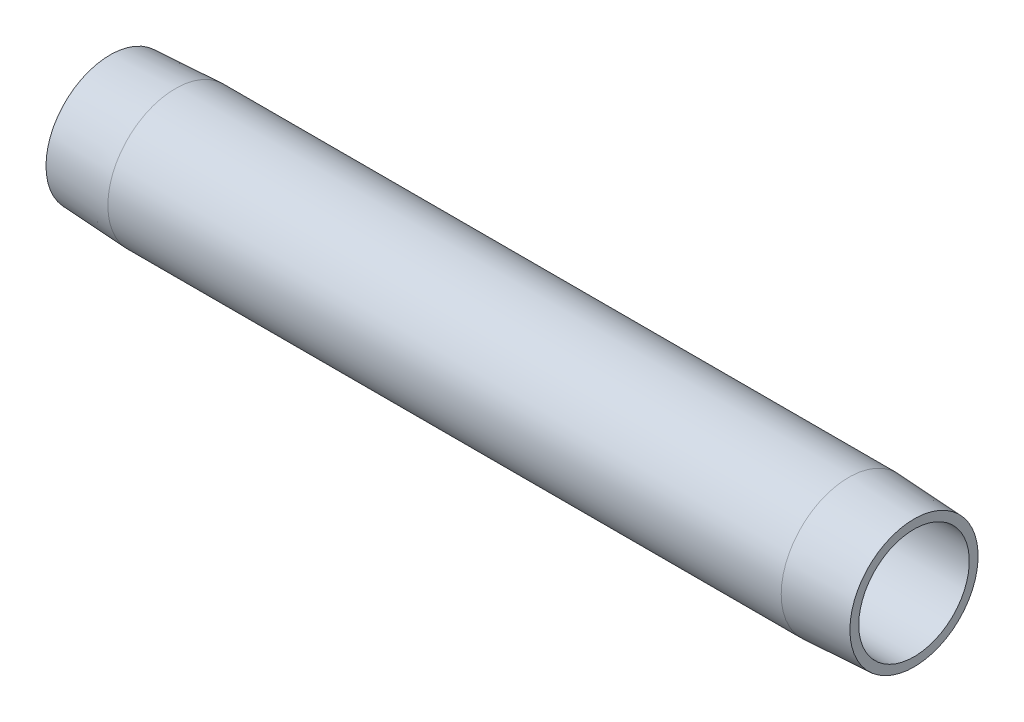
from build123d import *


with BuildPart() as part:
    # Sketch1 → Revolve1 (revolve)
    with BuildSketch(Plane.XY, mode=Mode.PRIVATE) as revolve1_sk:
        Polygon((127, 8.73125), (0, 8.73125), (0, 10.127550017), (10.3124, 10.668), (116.6876, 10.668), (127, 10.127550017), align=None)
    revolve(revolve1_sk.sketch.rotate(Axis((0, 0, 0), (1, 0, 0)), 90), axis=Axis((0, 0, 0), (1, 0, 0)))


solid = part.part
